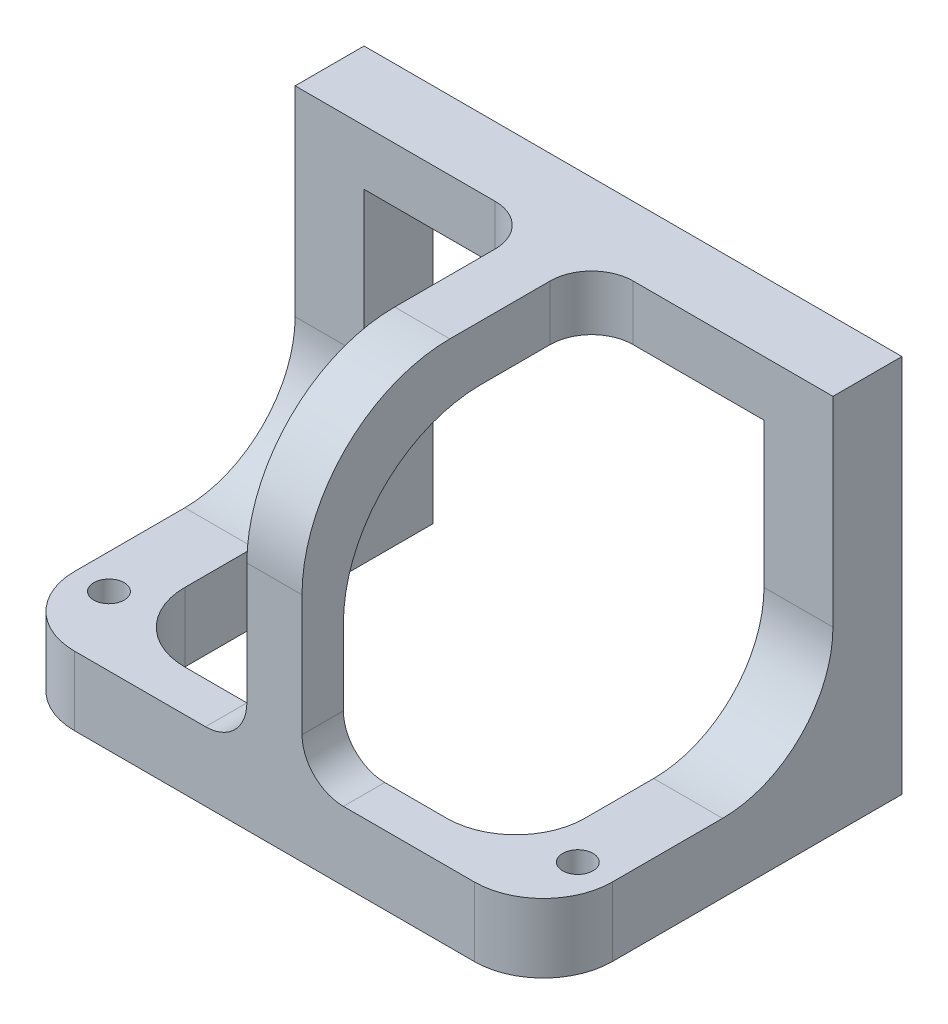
ISO-10303-21;
HEADER;
FILE_DESCRIPTION(('STEP AP214'),'2;1');
FILE_NAME('part.step','',(''),(''),'','','');
FILE_SCHEMA(('AUTOMOTIVE_DESIGN { 1 0 10303 214 1 1 1 1 }'));
ENDSEC;
DATA;
#1=APPLICATION_CONTEXT('core data for automotive mechanical design processes');
#2=APPLICATION_PROTOCOL_DEFINITION('international standard','automotive_design',2000,#1);
#3=PRODUCT_CONTEXT('',#1,'mechanical');
#4=PRODUCT('Part','Part','',(#3));
#5=PRODUCT_RELATED_PRODUCT_CATEGORY('part','',(#4));
#6=PRODUCT_DEFINITION_FORMATION('','',#4);
#7=PRODUCT_DEFINITION_CONTEXT('part definition',#1,'design');
#8=PRODUCT_DEFINITION('design','',#6,#7);
#9=PRODUCT_DEFINITION_SHAPE('','',#8);
#10=(LENGTH_UNIT() NAMED_UNIT(*) SI_UNIT(.MILLI.,.METRE.));
#11=(NAMED_UNIT(*) PLANE_ANGLE_UNIT() SI_UNIT($,.RADIAN.));
#12=(NAMED_UNIT(*) SI_UNIT($,.STERADIAN.) SOLID_ANGLE_UNIT());
#13=UNCERTAINTY_MEASURE_WITH_UNIT(LENGTH_MEASURE(1.E-05),#10,'distance_accuracy_value','');
#14=(GEOMETRIC_REPRESENTATION_CONTEXT(3) GLOBAL_UNCERTAINTY_ASSIGNED_CONTEXT((#13)) GLOBAL_UNIT_ASSIGNED_CONTEXT((#10,
#11,#12)) REPRESENTATION_CONTEXT('',''));
#15=CARTESIAN_POINT('',(0.,0.,0.));
#16=DIRECTION('',(0.,0.,1.));
#17=DIRECTION('',(1.,0.,0.));
#18=AXIS2_PLACEMENT_3D('',#15,#16,#17);
#19=CARTESIAN_POINT('',(0.,0.,5.));
#20=DIRECTION('',(0.,0.,1.));
#21=DIRECTION('',(1.,0.,0.));
#22=AXIS2_PLACEMENT_3D('',#19,#20,#21);
#23=PLANE('',#22);
#24=DIRECTION('',(1.,0.,0.));
#25=VECTOR('',#24,1.);
#26=CARTESIAN_POINT('',(-14.5,23.5,5.));
#27=LINE('',#26,#25);
#28=CARTESIAN_POINT('',(-14.5,23.5,5.));
#29=VERTEX_POINT('',#28);
#30=CARTESIAN_POINT('',(-5.,23.5,5.));
#31=VERTEX_POINT('',#30);
#32=EDGE_CURVE('E269',#29,#31,#27,.T.);
#33=ORIENTED_EDGE('',*,*,#32,.T.);
#34=DIRECTION('',(0.,1.,0.));
#35=VECTOR('',#34,1.);
#36=CARTESIAN_POINT('',(-5.,0.,5.));
#37=LINE('',#36,#35);
#38=CARTESIAN_POINT('',(-5.,27.5,5.));
#39=VERTEX_POINT('',#38);
#40=EDGE_CURVE('E301',#31,#39,#37,.T.);
#41=ORIENTED_EDGE('',*,*,#40,.T.);
#42=DIRECTION('',(-1.,0.,0.));
#43=VECTOR('',#42,1.);
#44=CARTESIAN_POINT('',(19.5,27.5,5.));
#45=LINE('',#44,#43);
#46=CARTESIAN_POINT('',(-19.5,27.5,5.));
#47=VERTEX_POINT('',#46);
#48=EDGE_CURVE('E286',#39,#47,#45,.T.);
#49=ORIENTED_EDGE('',*,*,#48,.T.);
#50=DIRECTION('',(0.,-1.,0.));
#51=VECTOR('',#50,1.);
#52=CARTESIAN_POINT('',(-19.5,4.,5.));
#53=LINE('',#52,#51);
#54=CARTESIAN_POINT('',(-19.5,13.,5.));
#55=VERTEX_POINT('',#54);
#56=EDGE_CURVE('E285',#47,#55,#53,.T.);
#57=ORIENTED_EDGE('',*,*,#56,.T.);
#58=DIRECTION('',(1.,0.,0.));
#59=VECTOR('',#58,1.);
#60=CARTESIAN_POINT('',(-14.5,13.,5.));
#61=LINE('',#60,#59);
#62=CARTESIAN_POINT('',(-14.5,13.,5.));
#63=VERTEX_POINT('',#62);
#64=EDGE_CURVE('E359',#55,#63,#61,.T.);
#65=ORIENTED_EDGE('',*,*,#64,.T.);
#66=DIRECTION('',(0.,1.,0.));
#67=VECTOR('',#66,1.);
#68=CARTESIAN_POINT('',(-14.5,23.5,5.));
#69=LINE('',#68,#67);
#70=EDGE_CURVE('E382',#63,#29,#69,.T.);
#71=ORIENTED_EDGE('',*,*,#70,.T.);
#72=EDGE_LOOP('',(#33,#41,#49,#57,#65,#71));
#73=FACE_BOUND('',#72,.T.);
#74=ADVANCED_FACE('F34',(#73),#23,.T.);
#75=CARTESIAN_POINT('',(14.5,23.5,5.));
#76=DIRECTION('',(1.,0.,0.));
#77=DIRECTION('',(0.,0.,-1.));
#78=AXIS2_PLACEMENT_3D('',#75,#76,#77);
#79=PLANE('',#78);
#80=DIRECTION('',(0.,0.,-1.));
#81=VECTOR('',#80,1.);
#82=CARTESIAN_POINT('',(14.5,0.,5.));
#83=LINE('',#82,#81);
#84=CARTESIAN_POINT('',(14.5,0.,18.));
#85=VERTEX_POINT('',#84);
#86=CARTESIAN_POINT('',(14.5,0.,0.));
#87=VERTEX_POINT('',#86);
#88=EDGE_CURVE('E278',#85,#87,#83,.T.);
#89=ORIENTED_EDGE('',*,*,#88,.F.);
#90=DIRECTION('',(0.,-1.,0.));
#91=VECTOR('',#90,1.);
#92=CARTESIAN_POINT('',(14.5,5.,18.));
#93=LINE('',#92,#91);
#94=CARTESIAN_POINT('',(14.5,5.,18.));
#95=VERTEX_POINT('',#94);
#96=EDGE_CURVE('E338',#85,#95,#93,.F.);
#97=ORIENTED_EDGE('',*,*,#96,.T.);
#98=DIRECTION('',(0.,0.,-1.));
#99=VECTOR('',#98,1.);
#100=CARTESIAN_POINT('',(14.5,5.,33.0710678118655));
#101=LINE('',#100,#99);
#102=CARTESIAN_POINT('',(14.5,5.,13.));
#103=VERTEX_POINT('',#102);
#104=EDGE_CURVE('E396',#95,#103,#101,.T.);
#105=ORIENTED_EDGE('',*,*,#104,.T.);
#106=CARTESIAN_POINT('',(14.5,13.,13.));
#107=DIRECTION('',(1.,0.,0.));
#108=DIRECTION('',(0.,0.,-1.));
#109=AXIS2_PLACEMENT_3D('',#106,#107,#108);
#110=CIRCLE('',#109,8.);
#111=CARTESIAN_POINT('',(14.5,13.,5.));
#112=VERTEX_POINT('',#111);
#113=EDGE_CURVE('E364',#103,#112,#110,.T.);
#114=ORIENTED_EDGE('',*,*,#113,.T.);
#115=DIRECTION('',(0.,-1.,0.));
#116=VECTOR('',#115,1.);
#117=CARTESIAN_POINT('',(14.5,23.5,5.));
#118=LINE('',#117,#116);
#119=CARTESIAN_POINT('',(14.5,23.5,5.));
#120=VERTEX_POINT('',#119);
#121=EDGE_CURVE('E264',#120,#112,#118,.T.);
#122=ORIENTED_EDGE('',*,*,#121,.F.);
#123=DIRECTION('',(0.,0.,-1.));
#124=VECTOR('',#123,1.);
#125=CARTESIAN_POINT('',(14.5,23.5,5.));
#126=LINE('',#125,#124);
#127=CARTESIAN_POINT('',(14.5,23.5,0.));
#128=VERTEX_POINT('',#127);
#129=EDGE_CURVE('E265',#120,#128,#126,.T.);
#130=ORIENTED_EDGE('',*,*,#129,.T.);
#131=DIRECTION('',(0.,-1.,0.));
#132=VECTOR('',#131,1.);
#133=CARTESIAN_POINT('',(14.5,23.5,0.));
#134=LINE('',#133,#132);
#135=EDGE_CURVE('E440',#128,#87,#134,.T.);
#136=ORIENTED_EDGE('',*,*,#135,.T.);
#137=EDGE_LOOP('',(#89,#97,#105,#114,#122,#130,#136));
#138=FACE_BOUND('',#137,.T.);
#139=ADVANCED_FACE('F559',(#138),#79,.F.);
#140=CARTESIAN_POINT('',(2.,13.5,13.));
#141=DIRECTION('',(1.,0.,0.));
#142=DIRECTION('',(0.,0.,-1.));
#143=AXIS2_PLACEMENT_3D('',#140,#141,#142);
#144=PLANE('',#143);
#145=DIRECTION('',(0.,0.,-1.));
#146=VECTOR('',#145,1.);
#147=CARTESIAN_POINT('',(2.,23.5,5.));
#148=LINE('',#147,#146);
#149=CARTESIAN_POINT('',(2.,23.5,13.));
#150=VERTEX_POINT('',#149);
#151=CARTESIAN_POINT('',(2.,23.5,8.));
#152=VERTEX_POINT('',#151);
#153=EDGE_CURVE('E415',#150,#152,#148,.T.);
#154=ORIENTED_EDGE('',*,*,#153,.T.);
#155=DIRECTION('',(0.,1.,0.));
#156=VECTOR('',#155,1.);
#157=CARTESIAN_POINT('',(2.,27.5,8.));
#158=LINE('',#157,#156);
#159=CARTESIAN_POINT('',(2.,27.5,8.));
#160=VERTEX_POINT('',#159);
#161=EDGE_CURVE('E495',#152,#160,#158,.T.);
#162=ORIENTED_EDGE('',*,*,#161,.T.);
#163=DIRECTION('',(0.,0.,1.));
#164=VECTOR('',#163,1.);
#165=CARTESIAN_POINT('',(2.,27.5,5.));
#166=LINE('',#165,#164);
#167=CARTESIAN_POINT('',(2.,27.5,15.283882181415));
#168=VERTEX_POINT('',#167);
#169=EDGE_CURVE('E408',#160,#168,#166,.T.);
#170=ORIENTED_EDGE('',*,*,#169,.T.);
#171=CARTESIAN_POINT('',(2.,16.783882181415,15.283882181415));
#172=DIRECTION('',(1.,0.,0.));
#173=DIRECTION('',(0.,0.,-1.));
#174=AXIS2_PLACEMENT_3D('',#171,#172,#173);
#175=CIRCLE('',#174,10.716117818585);
#176=CARTESIAN_POINT('',(2.,16.783882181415,26.));
#177=VERTEX_POINT('',#176);
#178=EDGE_CURVE('E405',#168,#177,#175,.T.);
#179=ORIENTED_EDGE('',*,*,#178,.T.);
#180=DIRECTION('',(0.,-1.,0.));
#181=VECTOR('',#180,1.);
#182=CARTESIAN_POINT('',(2.,0.,26.));
#183=LINE('',#182,#181);
#184=CARTESIAN_POINT('',(2.,8.,26.));
#185=VERTEX_POINT('',#184);
#186=EDGE_CURVE('E407',#177,#185,#183,.T.);
#187=ORIENTED_EDGE('',*,*,#186,.T.);
#188=DIRECTION('',(0.,0.,1.));
#189=VECTOR('',#188,1.);
#190=CARTESIAN_POINT('',(2.,8.,13.));
#191=LINE('',#190,#189);
#192=CARTESIAN_POINT('',(2.,8.,23.));
#193=VERTEX_POINT('',#192);
#194=EDGE_CURVE('E511',#185,#193,#191,.F.);
#195=ORIENTED_EDGE('',*,*,#194,.T.);
#196=DIRECTION('',(0.,1.,0.));
#197=VECTOR('',#196,1.);
#198=CARTESIAN_POINT('',(2.,13.5,23.));
#199=LINE('',#198,#197);
#200=CARTESIAN_POINT('',(2.,13.5,23.));
#201=VERTEX_POINT('',#200);
#202=EDGE_CURVE('E411',#193,#201,#199,.T.);
#203=ORIENTED_EDGE('',*,*,#202,.T.);
#204=CARTESIAN_POINT('',(2.,13.5,13.));
#205=DIRECTION('',(-1.,0.,0.));
#206=DIRECTION('',(0.,0.,-1.));
#207=AXIS2_PLACEMENT_3D('',#204,#205,#206);
#208=CIRCLE('',#207,10.);
#209=EDGE_CURVE('E413',#201,#150,#208,.T.);
#210=ORIENTED_EDGE('',*,*,#209,.T.);
#211=EDGE_LOOP('',(#154,#162,#170,#179,#187,#195,#203,#210));
#212=FACE_BOUND('',#211,.T.);
#213=ADVANCED_FACE('F541',(#212),#144,.T.);
#214=CARTESIAN_POINT('',(19.5,27.5,5.));
#215=VERTEX_POINT('',#214);
#216=CARTESIAN_POINT('',(5.,27.5,5.));
#217=VERTEX_POINT('',#216);
#218=EDGE_CURVE('E281',#215,#217,#45,.T.);
#219=ORIENTED_EDGE('',*,*,#218,.T.);
#220=DIRECTION('',(0.,1.,0.));
#221=VECTOR('',#220,1.);
#222=CARTESIAN_POINT('',(5.,23.5,5.));
#223=LINE('',#222,#221);
#224=CARTESIAN_POINT('',(5.,23.5,5.));
#225=VERTEX_POINT('',#224);
#226=EDGE_CURVE('E492',#217,#225,#223,.F.);
#227=ORIENTED_EDGE('',*,*,#226,.T.);
#228=EDGE_CURVE('E543',#225,#120,#27,.T.);
#229=ORIENTED_EDGE('',*,*,#228,.T.);
#230=ORIENTED_EDGE('',*,*,#121,.T.);
#231=DIRECTION('',(-1.,0.,0.));
#232=VECTOR('',#231,1.);
#233=CARTESIAN_POINT('',(0.,13.,5.));
#234=LINE('',#233,#232);
#235=CARTESIAN_POINT('',(19.5,13.,5.));
#236=VERTEX_POINT('',#235);
#237=EDGE_CURVE('E357',#112,#236,#234,.F.);
#238=ORIENTED_EDGE('',*,*,#237,.T.);
#239=DIRECTION('',(0.,1.,0.));
#240=VECTOR('',#239,1.);
#241=CARTESIAN_POINT('',(19.5,4.,5.));
#242=LINE('',#241,#240);
#243=EDGE_CURVE('E292',#236,#215,#242,.T.);
#244=ORIENTED_EDGE('',*,*,#243,.T.);
#245=EDGE_LOOP('',(#219,#227,#229,#230,#238,#244));
#246=FACE_BOUND('',#245,.T.);
#247=ADVANCED_FACE('F447',(#246),#23,.T.);
#248=CARTESIAN_POINT('',(19.5,4.,5.));
#249=DIRECTION('',(-1.,0.,0.));
#250=DIRECTION('',(0.,0.,1.));
#251=AXIS2_PLACEMENT_3D('',#248,#249,#250);
#252=PLANE('',#251);
#253=DIRECTION('',(0.,0.,-1.));
#254=VECTOR('',#253,1.);
#255=CARTESIAN_POINT('',(19.5,5.,33.0710678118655));
#256=LINE('',#255,#254);
#257=CARTESIAN_POINT('',(19.5,5.,21.));
#258=VERTEX_POINT('',#257);
#259=CARTESIAN_POINT('',(19.5,5.,13.));
#260=VERTEX_POINT('',#259);
#261=EDGE_CURVE('E399',#258,#260,#256,.T.);
#262=ORIENTED_EDGE('',*,*,#261,.F.);
#263=DIRECTION('',(0.,-1.,0.));
#264=VECTOR('',#263,1.);
#265=CARTESIAN_POINT('',(19.5,4.,21.));
#266=LINE('',#265,#264);
#267=CARTESIAN_POINT('',(19.5,0.,21.));
#268=VERTEX_POINT('',#267);
#269=EDGE_CURVE('E340',#258,#268,#266,.T.);
#270=ORIENTED_EDGE('',*,*,#269,.T.);
#271=DIRECTION('',(0.,0.,-1.));
#272=VECTOR('',#271,1.);
#273=CARTESIAN_POINT('',(19.5,0.,33.0710678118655));
#274=LINE('',#273,#272);
#275=CARTESIAN_POINT('',(19.5,0.,0.));
#276=VERTEX_POINT('',#275);
#277=EDGE_CURVE('E402',#268,#276,#274,.T.);
#278=ORIENTED_EDGE('',*,*,#277,.T.);
#279=DIRECTION('',(0.,1.,0.));
#280=VECTOR('',#279,1.);
#281=CARTESIAN_POINT('',(19.5,4.,0.));
#282=LINE('',#281,#280);
#283=CARTESIAN_POINT('',(19.5,27.5,0.));
#284=VERTEX_POINT('',#283);
#285=EDGE_CURVE('E454',#276,#284,#282,.T.);
#286=ORIENTED_EDGE('',*,*,#285,.T.);
#287=DIRECTION('',(0.,0.,-1.));
#288=VECTOR('',#287,1.);
#289=CARTESIAN_POINT('',(19.5,27.5,5.));
#290=LINE('',#289,#288);
#291=EDGE_CURVE('E275',#215,#284,#290,.T.);
#292=ORIENTED_EDGE('',*,*,#291,.F.);
#293=ORIENTED_EDGE('',*,*,#243,.F.);
#294=CARTESIAN_POINT('',(19.5,13.,13.));
#295=DIRECTION('',(-1.,0.,0.));
#296=DIRECTION('',(0.,0.,1.));
#297=AXIS2_PLACEMENT_3D('',#294,#295,#296);
#298=CIRCLE('',#297,8.);
#299=EDGE_CURVE('E366',#236,#260,#298,.T.);
#300=ORIENTED_EDGE('',*,*,#299,.T.);
#301=EDGE_LOOP('',(#262,#270,#278,#286,#292,#293,#300));
#302=FACE_BOUND('',#301,.T.);
#303=ADVANCED_FACE('F453',(#302),#252,.F.);
#304=CARTESIAN_POINT('',(19.5,27.5,5.));
#305=DIRECTION('',(0.,-1.,0.));
#306=DIRECTION('',(0.,0.,-1.));
#307=AXIS2_PLACEMENT_3D('',#304,#305,#306);
#308=PLANE('',#307);
#309=DIRECTION('',(-1.,0.,0.));
#310=VECTOR('',#309,1.);
#311=CARTESIAN_POINT('',(19.5,27.5,0.));
#312=LINE('',#311,#310);
#313=CARTESIAN_POINT('',(-19.5,27.5,0.));
#314=VERTEX_POINT('',#313);
#315=EDGE_CURVE('E252',#284,#314,#312,.T.);
#316=ORIENTED_EDGE('',*,*,#315,.T.);
#317=DIRECTION('',(0.,0.,-1.));
#318=VECTOR('',#317,1.);
#319=CARTESIAN_POINT('',(-19.5,27.5,5.));
#320=LINE('',#319,#318);
#321=EDGE_CURVE('E249',#47,#314,#320,.T.);
#322=ORIENTED_EDGE('',*,*,#321,.F.);
#323=ORIENTED_EDGE('',*,*,#48,.F.);
#324=CARTESIAN_POINT('',(-5.,27.5,8.));
#325=DIRECTION('',(0.,-1.,0.));
#326=DIRECTION('',(0.,0.,-1.));
#327=AXIS2_PLACEMENT_3D('',#324,#325,#326);
#328=CIRCLE('',#327,3.);
#329=CARTESIAN_POINT('',(-2.,27.5,8.));
#330=VERTEX_POINT('',#329);
#331=EDGE_CURVE('E468',#39,#330,#328,.T.);
#332=ORIENTED_EDGE('',*,*,#331,.T.);
#333=DIRECTION('',(0.,0.,1.));
#334=VECTOR('',#333,1.);
#335=CARTESIAN_POINT('',(-2.,27.5,5.));
#336=LINE('',#335,#334);
#337=CARTESIAN_POINT('',(-2.,27.5,15.283882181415));
#338=VERTEX_POINT('',#337);
#339=EDGE_CURVE('E305',#330,#338,#336,.T.);
#340=ORIENTED_EDGE('',*,*,#339,.T.);
#341=DIRECTION('',(-1.,0.,0.));
#342=VECTOR('',#341,1.);
#343=CARTESIAN_POINT('',(2.,27.5,15.283882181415));
#344=LINE('',#343,#342);
#345=EDGE_CURVE('E438',#168,#338,#344,.T.);
#346=ORIENTED_EDGE('',*,*,#345,.F.);
#347=ORIENTED_EDGE('',*,*,#169,.F.);
#348=CARTESIAN_POINT('',(5.,27.5,8.));
#349=DIRECTION('',(0.,-1.,0.));
#350=DIRECTION('',(0.,0.,-1.));
#351=AXIS2_PLACEMENT_3D('',#348,#349,#350);
#352=CIRCLE('',#351,3.);
#353=EDGE_CURVE('E458',#160,#217,#352,.T.);
#354=ORIENTED_EDGE('',*,*,#353,.T.);
#355=ORIENTED_EDGE('',*,*,#218,.F.);
#356=ORIENTED_EDGE('',*,*,#291,.T.);
#357=EDGE_LOOP('',(#316,#322,#323,#332,#340,#346,#347,#354,#355,#356));
#358=FACE_BOUND('',#357,.T.);
#359=ADVANCED_FACE('F456',(#358),#308,.F.);
#360=CARTESIAN_POINT('',(-19.5,4.,5.));
#361=DIRECTION('',(1.,0.,0.));
#362=DIRECTION('',(0.,0.,-1.));
#363=AXIS2_PLACEMENT_3D('',#360,#361,#362);
#364=PLANE('',#363);
#365=DIRECTION('',(0.,0.,-1.));
#366=VECTOR('',#365,1.);
#367=CARTESIAN_POINT('',(-19.5,0.,33.0710678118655));
#368=LINE('',#367,#366);
#369=CARTESIAN_POINT('',(-19.5,0.,21.));
#370=VERTEX_POINT('',#369);
#371=CARTESIAN_POINT('',(-19.5,0.,0.));
#372=VERTEX_POINT('',#371);
#373=EDGE_CURVE('E229',#370,#372,#368,.T.);
#374=ORIENTED_EDGE('',*,*,#373,.F.);
#375=DIRECTION('',(0.,-1.,0.));
#376=VECTOR('',#375,1.);
#377=CARTESIAN_POINT('',(-19.5,4.,21.));
#378=LINE('',#377,#376);
#379=CARTESIAN_POINT('',(-19.5,5.,21.));
#380=VERTEX_POINT('',#379);
#381=EDGE_CURVE('E333',#370,#380,#378,.F.);
#382=ORIENTED_EDGE('',*,*,#381,.T.);
#383=DIRECTION('',(0.,0.,-1.));
#384=VECTOR('',#383,1.);
#385=CARTESIAN_POINT('',(-19.5,5.,33.0710678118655));
#386=LINE('',#385,#384);
#387=CARTESIAN_POINT('',(-19.5,5.,13.));
#388=VERTEX_POINT('',#387);
#389=EDGE_CURVE('E240',#380,#388,#386,.T.);
#390=ORIENTED_EDGE('',*,*,#389,.T.);
#391=CARTESIAN_POINT('',(-19.5,13.,13.));
#392=DIRECTION('',(1.,0.,0.));
#393=DIRECTION('',(0.,0.,-1.));
#394=AXIS2_PLACEMENT_3D('',#391,#392,#393);
#395=CIRCLE('',#394,8.);
#396=EDGE_CURVE('E299',#388,#55,#395,.T.);
#397=ORIENTED_EDGE('',*,*,#396,.T.);
#398=ORIENTED_EDGE('',*,*,#56,.F.);
#399=ORIENTED_EDGE('',*,*,#321,.T.);
#400=DIRECTION('',(0.,-1.,0.));
#401=VECTOR('',#400,1.);
#402=CARTESIAN_POINT('',(-19.5,4.,0.));
#403=LINE('',#402,#401);
#404=EDGE_CURVE('E245',#314,#372,#403,.T.);
#405=ORIENTED_EDGE('',*,*,#404,.T.);
#406=EDGE_LOOP('',(#374,#382,#390,#397,#398,#399,#405));
#407=FACE_BOUND('',#406,.T.);
#408=ADVANCED_FACE('F246',(#407),#364,.F.);
#409=CARTESIAN_POINT('',(-14.5,0.,5.));
#410=DIRECTION('',(0.,1.,0.));
#411=DIRECTION('',(-1.,0.,0.));
#412=AXIS2_PLACEMENT_3D('',#409,#410,#411);
#413=PLANE('',#412);
#414=CARTESIAN_POINT('',(-17.,0.,21.));
#415=DIRECTION('',(0.,1.,0.));
#416=DIRECTION('',(0.,0.,1.));
#417=AXIS2_PLACEMENT_3D('',#414,#415,#416);
#418=CIRCLE('',#417,1.1);
#419=CARTESIAN_POINT('',(-17.,0.,22.1));
#420=VERTEX_POINT('',#419);
#421=EDGE_CURVE('E783',#420,#420,#418,.T.);
#422=ORIENTED_EDGE('',*,*,#421,.T.);
#423=EDGE_LOOP('',(#422));
#424=FACE_BOUND('',#423,.T.);
#425=CARTESIAN_POINT('',(17.,0.,21.));
#426=DIRECTION('',(0.,1.,0.));
#427=DIRECTION('',(0.,0.,-1.));
#428=AXIS2_PLACEMENT_3D('',#425,#426,#427);
#429=CIRCLE('',#428,1.1);
#430=CARTESIAN_POINT('',(17.,0.,19.9));
#431=VERTEX_POINT('',#430);
#432=EDGE_CURVE('E791',#431,#431,#429,.T.);
#433=ORIENTED_EDGE('',*,*,#432,.T.);
#434=EDGE_LOOP('',(#433));
#435=FACE_BOUND('',#434,.T.);
#436=CARTESIAN_POINT('',(17.,0.,2.5));
#437=DIRECTION('',(0.,1.,0.));
#438=DIRECTION('',(0.,0.,-1.));
#439=AXIS2_PLACEMENT_3D('',#436,#437,#438);
#440=CIRCLE('',#439,1.);
#441=CARTESIAN_POINT('',(17.,0.,1.5));
#442=VERTEX_POINT('',#441);
#443=EDGE_CURVE('E794',#442,#442,#440,.T.);
#444=ORIENTED_EDGE('',*,*,#443,.T.);
#445=EDGE_LOOP('',(#444));
#446=FACE_BOUND('',#445,.T.);
#447=CARTESIAN_POINT('',(-17.,0.,2.5));
#448=DIRECTION('',(0.,1.,0.));
#449=DIRECTION('',(0.,0.,1.));
#450=AXIS2_PLACEMENT_3D('',#447,#448,#449);
#451=CIRCLE('',#450,1.);
#452=CARTESIAN_POINT('',(-17.,0.,3.5));
#453=VERTEX_POINT('',#452);
#454=EDGE_CURVE('E776',#453,#453,#451,.T.);
#455=ORIENTED_EDGE('',*,*,#454,.T.);
#456=EDGE_LOOP('',(#455));
#457=FACE_BOUND('',#456,.T.);
#458=DIRECTION('',(-1.,0.,0.));
#459=VECTOR('',#458,1.);
#460=CARTESIAN_POINT('',(2.,0.,26.));
#461=LINE('',#460,#459);
#462=CARTESIAN_POINT('',(14.5,0.,26.));
#463=VERTEX_POINT('',#462);
#464=CARTESIAN_POINT('',(-14.5,0.,26.));
#465=VERTEX_POINT('',#464);
#466=EDGE_CURVE('E433',#463,#465,#461,.T.);
#467=ORIENTED_EDGE('',*,*,#466,.T.);
#468=CARTESIAN_POINT('',(-14.5,0.,21.));
#469=DIRECTION('',(0.,1.,0.));
#470=DIRECTION('',(-1.,0.,0.));
#471=AXIS2_PLACEMENT_3D('',#468,#469,#470);
#472=CIRCLE('',#471,5.);
#473=EDGE_CURVE('E237',#465,#370,#472,.F.);
#474=ORIENTED_EDGE('',*,*,#473,.T.);
#475=ORIENTED_EDGE('',*,*,#373,.T.);
#476=DIRECTION('',(1.,0.,0.));
#477=VECTOR('',#476,1.);
#478=CARTESIAN_POINT('',(-14.5,0.,0.));
#479=LINE('',#478,#477);
#480=CARTESIAN_POINT('',(-14.5,0.,0.));
#481=VERTEX_POINT('',#480);
#482=EDGE_CURVE('E235',#372,#481,#479,.T.);
#483=ORIENTED_EDGE('',*,*,#482,.T.);
#484=DIRECTION('',(0.,0.,-1.));
#485=VECTOR('',#484,1.);
#486=CARTESIAN_POINT('',(-14.5,0.,5.));
#487=LINE('',#486,#485);
#488=CARTESIAN_POINT('',(-14.5,0.,18.));
#489=VERTEX_POINT('',#488);
#490=EDGE_CURVE('E272',#489,#481,#487,.T.);
#491=ORIENTED_EDGE('',*,*,#490,.F.);
#492=CARTESIAN_POINT('',(-9.5,0.,18.));
#493=DIRECTION('',(0.,1.,0.));
#494=DIRECTION('',(-1.,0.,0.));
#495=AXIS2_PLACEMENT_3D('',#492,#493,#494);
#496=CIRCLE('',#495,5.);
#497=CARTESIAN_POINT('',(-9.5,0.,23.));
#498=VERTEX_POINT('',#497);
#499=EDGE_CURVE('E345',#489,#498,#496,.T.);
#500=ORIENTED_EDGE('',*,*,#499,.T.);
#501=DIRECTION('',(-1.,0.,0.));
#502=VECTOR('',#501,1.);
#503=CARTESIAN_POINT('',(2.,0.,23.));
#504=LINE('',#503,#502);
#505=CARTESIAN_POINT('',(9.5,0.,23.));
#506=VERTEX_POINT('',#505);
#507=EDGE_CURVE('E430',#506,#498,#504,.T.);
#508=ORIENTED_EDGE('',*,*,#507,.F.);
#509=CARTESIAN_POINT('',(9.5,0.,18.));
#510=DIRECTION('',(0.,1.,0.));
#511=DIRECTION('',(-1.,0.,0.));
#512=AXIS2_PLACEMENT_3D('',#509,#510,#511);
#513=CIRCLE('',#512,5.);
#514=EDGE_CURVE('E349',#506,#85,#513,.T.);
#515=ORIENTED_EDGE('',*,*,#514,.T.);
#516=ORIENTED_EDGE('',*,*,#88,.T.);
#517=DIRECTION('',(1.,0.,0.));
#518=VECTOR('',#517,1.);
#519=CARTESIAN_POINT('',(14.5,0.,0.));
#520=LINE('',#519,#518);
#521=EDGE_CURVE('E549',#87,#276,#520,.T.);
#522=ORIENTED_EDGE('',*,*,#521,.T.);
#523=ORIENTED_EDGE('',*,*,#277,.F.);
#524=CARTESIAN_POINT('',(14.5,0.,21.));
#525=DIRECTION('',(0.,1.,0.));
#526=DIRECTION('',(-1.,0.,0.));
#527=AXIS2_PLACEMENT_3D('',#524,#525,#526);
#528=CIRCLE('',#527,5.);
#529=EDGE_CURVE('E330',#268,#463,#528,.F.);
#530=ORIENTED_EDGE('',*,*,#529,.T.);
#531=EDGE_LOOP('',(#467,#474,#475,#483,#491,#500,#508,#515,#516,#522,#523,#530));
#532=FACE_BOUND('',#531,.T.);
#533=ADVANCED_FACE('F232',(#424,#435,#446,#457,#532),#413,.F.);
#534=CARTESIAN_POINT('',(-14.5,23.5,5.));
#535=DIRECTION('',(-1.,0.,0.));
#536=DIRECTION('',(0.,0.,1.));
#537=AXIS2_PLACEMENT_3D('',#534,#535,#536);
#538=PLANE('',#537);
#539=DIRECTION('',(0.,0.,-1.));
#540=VECTOR('',#539,1.);
#541=CARTESIAN_POINT('',(-14.5,5.,33.0710678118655));
#542=LINE('',#541,#540);
#543=CARTESIAN_POINT('',(-14.5,5.,18.));
#544=VERTEX_POINT('',#543);
#545=CARTESIAN_POINT('',(-14.5,5.,13.));
#546=VERTEX_POINT('',#545);
#547=EDGE_CURVE('E386',#544,#546,#542,.T.);
#548=ORIENTED_EDGE('',*,*,#547,.F.);
#549=DIRECTION('',(0.,-1.,0.));
#550=VECTOR('',#549,1.);
#551=CARTESIAN_POINT('',(-14.5,0.,18.));
#552=LINE('',#551,#550);
#553=EDGE_CURVE('E280',#544,#489,#552,.T.);
#554=ORIENTED_EDGE('',*,*,#553,.T.);
#555=ORIENTED_EDGE('',*,*,#490,.T.);
#556=DIRECTION('',(0.,1.,0.));
#557=VECTOR('',#556,1.);
#558=CARTESIAN_POINT('',(-14.5,23.5,0.));
#559=LINE('',#558,#557);
#560=CARTESIAN_POINT('',(-14.5,23.5,0.));
#561=VERTEX_POINT('',#560);
#562=EDGE_CURVE('E257',#481,#561,#559,.T.);
#563=ORIENTED_EDGE('',*,*,#562,.T.);
#564=DIRECTION('',(0.,0.,-1.));
#565=VECTOR('',#564,1.);
#566=CARTESIAN_POINT('',(-14.5,23.5,5.));
#567=LINE('',#566,#565);
#568=EDGE_CURVE('E268',#29,#561,#567,.T.);
#569=ORIENTED_EDGE('',*,*,#568,.F.);
#570=ORIENTED_EDGE('',*,*,#70,.F.);
#571=CARTESIAN_POINT('',(-14.5,13.,13.));
#572=DIRECTION('',(-1.,0.,0.));
#573=DIRECTION('',(0.,0.,1.));
#574=AXIS2_PLACEMENT_3D('',#571,#572,#573);
#575=CIRCLE('',#574,8.);
#576=EDGE_CURVE('E367',#63,#546,#575,.T.);
#577=ORIENTED_EDGE('',*,*,#576,.T.);
#578=EDGE_LOOP('',(#548,#554,#555,#563,#569,#570,#577));
#579=FACE_BOUND('',#578,.T.);
#580=ADVANCED_FACE('F565',(#579),#538,.F.);
#581=CARTESIAN_POINT('',(-14.5,23.5,5.));
#582=DIRECTION('',(0.,1.,0.));
#583=DIRECTION('',(0.,0.,1.));
#584=AXIS2_PLACEMENT_3D('',#581,#582,#583);
#585=PLANE('',#584);
#586=DIRECTION('',(1.,0.,0.));
#587=VECTOR('',#586,1.);
#588=CARTESIAN_POINT('',(-14.5,23.5,0.));
#589=LINE('',#588,#587);
#590=EDGE_CURVE('E259',#561,#128,#589,.T.);
#591=ORIENTED_EDGE('',*,*,#590,.T.);
#592=ORIENTED_EDGE('',*,*,#129,.F.);
#593=ORIENTED_EDGE('',*,*,#228,.F.);
#594=CARTESIAN_POINT('',(5.,23.5,8.));
#595=DIRECTION('',(0.,1.,0.));
#596=DIRECTION('',(0.,0.,1.));
#597=AXIS2_PLACEMENT_3D('',#594,#595,#596);
#598=CIRCLE('',#597,3.);
#599=EDGE_CURVE('E463',#225,#152,#598,.T.);
#600=ORIENTED_EDGE('',*,*,#599,.T.);
#601=ORIENTED_EDGE('',*,*,#153,.F.);
#602=DIRECTION('',(-1.,0.,0.));
#603=VECTOR('',#602,1.);
#604=CARTESIAN_POINT('',(2.,23.5,13.));
#605=LINE('',#604,#603);
#606=CARTESIAN_POINT('',(-2.,23.5,13.));
#607=VERTEX_POINT('',#606);
#608=EDGE_CURVE('E424',#150,#607,#605,.T.);
#609=ORIENTED_EDGE('',*,*,#608,.T.);
#610=DIRECTION('',(0.,0.,-1.));
#611=VECTOR('',#610,1.);
#612=CARTESIAN_POINT('',(-2.,23.5,5.));
#613=LINE('',#612,#611);
#614=CARTESIAN_POINT('',(-2.,23.5,8.));
#615=VERTEX_POINT('',#614);
#616=EDGE_CURVE('E423',#607,#615,#613,.T.);
#617=ORIENTED_EDGE('',*,*,#616,.T.);
#618=CARTESIAN_POINT('',(-5.,23.5,8.));
#619=DIRECTION('',(0.,1.,0.));
#620=DIRECTION('',(0.,0.,1.));
#621=AXIS2_PLACEMENT_3D('',#618,#619,#620);
#622=CIRCLE('',#621,3.);
#623=EDGE_CURVE('E464',#615,#31,#622,.T.);
#624=ORIENTED_EDGE('',*,*,#623,.T.);
#625=ORIENTED_EDGE('',*,*,#32,.F.);
#626=ORIENTED_EDGE('',*,*,#568,.T.);
#627=EDGE_LOOP('',(#591,#592,#593,#600,#601,#609,#617,#624,#625,#626));
#628=FACE_BOUND('',#627,.T.);
#629=ADVANCED_FACE('F522',(#628),#585,.F.);
#630=CARTESIAN_POINT('',(0.,0.,0.));
#631=DIRECTION('',(0.,0.,1.));
#632=DIRECTION('',(1.,0.,0.));
#633=AXIS2_PLACEMENT_3D('',#630,#631,#632);
#634=PLANE('',#633);
#635=ORIENTED_EDGE('',*,*,#285,.F.);
#636=ORIENTED_EDGE('',*,*,#521,.F.);
#637=ORIENTED_EDGE('',*,*,#135,.F.);
#638=ORIENTED_EDGE('',*,*,#590,.F.);
#639=ORIENTED_EDGE('',*,*,#562,.F.);
#640=ORIENTED_EDGE('',*,*,#482,.F.);
#641=ORIENTED_EDGE('',*,*,#404,.F.);
#642=ORIENTED_EDGE('',*,*,#315,.F.);
#643=EDGE_LOOP('',(#635,#636,#637,#638,#639,#640,#641,#642));
#644=FACE_BOUND('',#643,.T.);
#645=ADVANCED_FACE('F255',(#644),#634,.F.);
#646=CARTESIAN_POINT('',(2.,16.783882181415,15.283882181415));
#647=DIRECTION('',(-1.,0.,0.));
#648=DIRECTION('',(0.,0.,1.));
#649=AXIS2_PLACEMENT_3D('',#646,#647,#648);
#650=CYLINDRICAL_SURFACE('',#649,10.716117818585);
#651=CARTESIAN_POINT('',(-2.,16.783882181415,15.283882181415));
#652=DIRECTION('',(1.,0.,0.));
#653=DIRECTION('',(0.,0.,-1.));
#654=AXIS2_PLACEMENT_3D('',#651,#652,#653);
#655=CIRCLE('',#654,10.716117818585);
#656=CARTESIAN_POINT('',(-2.,16.783882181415,26.));
#657=VERTEX_POINT('',#656);
#658=EDGE_CURVE('E308',#338,#657,#655,.T.);
#659=ORIENTED_EDGE('',*,*,#658,.T.);
#660=DIRECTION('',(-1.,0.,0.));
#661=VECTOR('',#660,1.);
#662=CARTESIAN_POINT('',(2.,16.783882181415,26.));
#663=LINE('',#662,#661);
#664=EDGE_CURVE('E435',#177,#657,#663,.T.);
#665=ORIENTED_EDGE('',*,*,#664,.F.);
#666=ORIENTED_EDGE('',*,*,#178,.F.);
#667=ORIENTED_EDGE('',*,*,#345,.T.);
#668=EDGE_LOOP('',(#659,#665,#666,#667));
#669=FACE_BOUND('',#668,.T.);
#670=ADVANCED_FACE('F539',(#669),#650,.T.);
#671=CARTESIAN_POINT('',(2.,0.,26.));
#672=DIRECTION('',(0.,0.,-1.));
#673=DIRECTION('',(0.,1.,0.));
#674=AXIS2_PLACEMENT_3D('',#671,#672,#673);
#675=PLANE('',#674);
#676=DIRECTION('',(0.,-1.,0.));
#677=VECTOR('',#676,1.);
#678=CARTESIAN_POINT('',(-2.,0.,26.));
#679=LINE('',#678,#677);
#680=CARTESIAN_POINT('',(-2.,8.,26.));
#681=VERTEX_POINT('',#680);
#682=EDGE_CURVE('E417',#657,#681,#679,.T.);
#683=ORIENTED_EDGE('',*,*,#682,.T.);
#684=CARTESIAN_POINT('',(-5.,8.,26.));
#685=DIRECTION('',(0.,0.,-1.));
#686=DIRECTION('',(0.,1.,0.));
#687=AXIS2_PLACEMENT_3D('',#684,#685,#686);
#688=CIRCLE('',#687,3.);
#689=CARTESIAN_POINT('',(-5.,5.,26.));
#690=VERTEX_POINT('',#689);
#691=EDGE_CURVE('E42',#681,#690,#688,.T.);
#692=ORIENTED_EDGE('',*,*,#691,.T.);
#693=DIRECTION('',(-1.,0.,0.));
#694=VECTOR('',#693,1.);
#695=CARTESIAN_POINT('',(-14.5,5.,26.));
#696=LINE('',#695,#694);
#697=CARTESIAN_POINT('',(-14.5,5.,26.));
#698=VERTEX_POINT('',#697);
#699=EDGE_CURVE('E389',#690,#698,#696,.T.);
#700=ORIENTED_EDGE('',*,*,#699,.T.);
#701=DIRECTION('',(0.,-1.,0.));
#702=VECTOR('',#701,1.);
#703=CARTESIAN_POINT('',(-14.5,0.,26.));
#704=LINE('',#703,#702);
#705=EDGE_CURVE('E327',#698,#465,#704,.T.);
#706=ORIENTED_EDGE('',*,*,#705,.T.);
#707=ORIENTED_EDGE('',*,*,#466,.F.);
#708=DIRECTION('',(0.,-1.,0.));
#709=VECTOR('',#708,1.);
#710=CARTESIAN_POINT('',(14.5,0.,26.));
#711=LINE('',#710,#709);
#712=CARTESIAN_POINT('',(14.5,5.,26.));
#713=VERTEX_POINT('',#712);
#714=EDGE_CURVE('E324',#463,#713,#711,.F.);
#715=ORIENTED_EDGE('',*,*,#714,.T.);
#716=DIRECTION('',(1.,0.,0.));
#717=VECTOR('',#716,1.);
#718=CARTESIAN_POINT('',(14.5,5.,26.));
#719=LINE('',#718,#717);
#720=CARTESIAN_POINT('',(5.,5.,26.));
#721=VERTEX_POINT('',#720);
#722=EDGE_CURVE('E309',#721,#713,#719,.T.);
#723=ORIENTED_EDGE('',*,*,#722,.F.);
#724=CARTESIAN_POINT('',(5.,8.,26.));
#725=DIRECTION('',(0.,0.,-1.));
#726=DIRECTION('',(0.,1.,0.));
#727=AXIS2_PLACEMENT_3D('',#724,#725,#726);
#728=CIRCLE('',#727,3.);
#729=EDGE_CURVE('E466',#721,#185,#728,.T.);
#730=ORIENTED_EDGE('',*,*,#729,.T.);
#731=ORIENTED_EDGE('',*,*,#186,.F.);
#732=ORIENTED_EDGE('',*,*,#664,.T.);
#733=EDGE_LOOP('',(#683,#692,#700,#706,#707,#715,#723,#730,#731,#732));
#734=FACE_BOUND('',#733,.T.);
#735=ADVANCED_FACE('F534',(#734),#675,.F.);
#736=CARTESIAN_POINT('',(2.,13.5,23.));
#737=DIRECTION('',(0.,0.,1.));
#738=DIRECTION('',(0.,-1.,0.));
#739=AXIS2_PLACEMENT_3D('',#736,#737,#738);
#740=PLANE('',#739);
#741=ORIENTED_EDGE('',*,*,#507,.T.);
#742=DIRECTION('',(0.,-1.,0.));
#743=VECTOR('',#742,1.);
#744=CARTESIAN_POINT('',(-9.5,5.,23.));
#745=LINE('',#744,#743);
#746=CARTESIAN_POINT('',(-9.5,5.,23.));
#747=VERTEX_POINT('',#746);
#748=EDGE_CURVE('E321',#498,#747,#745,.F.);
#749=ORIENTED_EDGE('',*,*,#748,.T.);
#750=DIRECTION('',(-1.,0.,0.));
#751=VECTOR('',#750,1.);
#752=CARTESIAN_POINT('',(7.8309518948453,5.,23.));
#753=LINE('',#752,#751);
#754=CARTESIAN_POINT('',(-5.,5.,23.));
#755=VERTEX_POINT('',#754);
#756=EDGE_CURVE('E241',#755,#747,#753,.T.);
#757=ORIENTED_EDGE('',*,*,#756,.F.);
#758=CARTESIAN_POINT('',(-5.,8.,23.));
#759=DIRECTION('',(0.,0.,1.));
#760=DIRECTION('',(0.,-1.,0.));
#761=AXIS2_PLACEMENT_3D('',#758,#759,#760);
#762=CIRCLE('',#761,3.);
#763=CARTESIAN_POINT('',(-2.,8.,23.));
#764=VERTEX_POINT('',#763);
#765=EDGE_CURVE('E11',#755,#764,#762,.T.);
#766=ORIENTED_EDGE('',*,*,#765,.T.);
#767=DIRECTION('',(0.,1.,0.));
#768=VECTOR('',#767,1.);
#769=CARTESIAN_POINT('',(-2.,13.5,23.));
#770=LINE('',#769,#768);
#771=CARTESIAN_POINT('',(-2.,13.5,23.));
#772=VERTEX_POINT('',#771);
#773=EDGE_CURVE('E419',#764,#772,#770,.T.);
#774=ORIENTED_EDGE('',*,*,#773,.T.);
#775=DIRECTION('',(-1.,0.,0.));
#776=VECTOR('',#775,1.);
#777=CARTESIAN_POINT('',(2.,13.5,23.));
#778=LINE('',#777,#776);
#779=EDGE_CURVE('E427',#201,#772,#778,.T.);
#780=ORIENTED_EDGE('',*,*,#779,.F.);
#781=ORIENTED_EDGE('',*,*,#202,.F.);
#782=CARTESIAN_POINT('',(5.,8.,23.));
#783=DIRECTION('',(0.,0.,1.));
#784=DIRECTION('',(0.,-1.,0.));
#785=AXIS2_PLACEMENT_3D('',#782,#783,#784);
#786=CIRCLE('',#785,3.);
#787=CARTESIAN_POINT('',(5.,5.,23.));
#788=VERTEX_POINT('',#787);
#789=EDGE_CURVE('E473',#193,#788,#786,.T.);
#790=ORIENTED_EDGE('',*,*,#789,.T.);
#791=DIRECTION('',(1.,0.,0.));
#792=VECTOR('',#791,1.);
#793=CARTESIAN_POINT('',(-3.8309518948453,5.,23.));
#794=LINE('',#793,#792);
#795=CARTESIAN_POINT('',(9.5,5.,23.));
#796=VERTEX_POINT('',#795);
#797=EDGE_CURVE('E391',#788,#796,#794,.T.);
#798=ORIENTED_EDGE('',*,*,#797,.T.);
#799=DIRECTION('',(0.,-1.,0.));
#800=VECTOR('',#799,1.);
#801=CARTESIAN_POINT('',(9.5,0.,23.));
#802=LINE('',#801,#800);
#803=EDGE_CURVE('E318',#796,#506,#802,.T.);
#804=ORIENTED_EDGE('',*,*,#803,.T.);
#805=EDGE_LOOP('',(#741,#749,#757,#766,#774,#780,#781,#790,#798,#804));
#806=FACE_BOUND('',#805,.T.);
#807=ADVANCED_FACE('F478',(#806),#740,.F.);
#808=CARTESIAN_POINT('',(2.,13.5,13.));
#809=DIRECTION('',(-1.,0.,0.));
#810=DIRECTION('',(0.,0.,1.));
#811=AXIS2_PLACEMENT_3D('',#808,#809,#810);
#812=CYLINDRICAL_SURFACE('',#811,10.);
#813=CARTESIAN_POINT('',(-2.,13.5,13.));
#814=DIRECTION('',(-1.,0.,0.));
#815=DIRECTION('',(0.,0.,-1.));
#816=AXIS2_PLACEMENT_3D('',#813,#814,#815);
#817=CIRCLE('',#816,10.);
#818=EDGE_CURVE('E421',#772,#607,#817,.T.);
#819=ORIENTED_EDGE('',*,*,#818,.T.);
#820=ORIENTED_EDGE('',*,*,#608,.F.);
#821=ORIENTED_EDGE('',*,*,#209,.F.);
#822=ORIENTED_EDGE('',*,*,#779,.T.);
#823=EDGE_LOOP('',(#819,#820,#821,#822));
#824=FACE_BOUND('',#823,.T.);
#825=ADVANCED_FACE('F530',(#824),#812,.F.);
#826=CARTESIAN_POINT('',(-2.,13.5,13.));
#827=DIRECTION('',(1.,0.,0.));
#828=DIRECTION('',(0.,0.,-1.));
#829=AXIS2_PLACEMENT_3D('',#826,#827,#828);
#830=PLANE('',#829);
#831=ORIENTED_EDGE('',*,*,#339,.F.);
#832=DIRECTION('',(0.,1.,0.));
#833=VECTOR('',#832,1.);
#834=CARTESIAN_POINT('',(-2.,13.5,8.));
#835=LINE('',#834,#833);
#836=EDGE_CURVE('E506',#330,#615,#835,.F.);
#837=ORIENTED_EDGE('',*,*,#836,.T.);
#838=ORIENTED_EDGE('',*,*,#616,.F.);
#839=ORIENTED_EDGE('',*,*,#818,.F.);
#840=ORIENTED_EDGE('',*,*,#773,.F.);
#841=DIRECTION('',(0.,0.,1.));
#842=VECTOR('',#841,1.);
#843=CARTESIAN_POINT('',(-2.,8.,13.));
#844=LINE('',#843,#842);
#845=EDGE_CURVE('E304',#764,#681,#844,.T.);
#846=ORIENTED_EDGE('',*,*,#845,.T.);
#847=ORIENTED_EDGE('',*,*,#682,.F.);
#848=ORIENTED_EDGE('',*,*,#658,.F.);
#849=EDGE_LOOP('',(#831,#837,#838,#839,#840,#846,#847,#848));
#850=FACE_BOUND('',#849,.T.);
#851=ADVANCED_FACE('F504',(#850),#830,.F.);
#852=CARTESIAN_POINT('',(14.5,5.,33.0710678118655));
#853=DIRECTION('',(0.,-1.,0.));
#854=DIRECTION('',(1.,0.,0.));
#855=AXIS2_PLACEMENT_3D('',#852,#853,#854);
#856=PLANE('',#855);
#857=CARTESIAN_POINT('',(17.,5.,21.));
#858=DIRECTION('',(0.,1.,0.));
#859=DIRECTION('',(0.,0.,-1.));
#860=AXIS2_PLACEMENT_3D('',#857,#858,#859);
#861=CIRCLE('',#860,1.1);
#862=CARTESIAN_POINT('',(17.,5.,19.9));
#863=VERTEX_POINT('',#862);
#864=EDGE_CURVE('E789',#863,#863,#861,.T.);
#865=ORIENTED_EDGE('',*,*,#864,.F.);
#866=EDGE_LOOP('',(#865));
#867=FACE_BOUND('',#866,.T.);
#868=ORIENTED_EDGE('',*,*,#797,.F.);
#869=DIRECTION('',(0.,0.,1.));
#870=VECTOR('',#869,1.);
#871=CARTESIAN_POINT('',(5.,5.,33.0710678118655));
#872=LINE('',#871,#870);
#873=EDGE_CURVE('E486',#788,#721,#872,.T.);
#874=ORIENTED_EDGE('',*,*,#873,.T.);
#875=ORIENTED_EDGE('',*,*,#722,.T.);
#876=CARTESIAN_POINT('',(14.5,5.,21.));
#877=DIRECTION('',(0.,-1.,0.));
#878=DIRECTION('',(1.,0.,0.));
#879=AXIS2_PLACEMENT_3D('',#876,#877,#878);
#880=CIRCLE('',#879,5.);
#881=EDGE_CURVE('E343',#713,#258,#880,.F.);
#882=ORIENTED_EDGE('',*,*,#881,.T.);
#883=ORIENTED_EDGE('',*,*,#261,.T.);
#884=DIRECTION('',(-1.,0.,0.));
#885=VECTOR('',#884,1.);
#886=CARTESIAN_POINT('',(14.5,5.,13.));
#887=LINE('',#886,#885);
#888=EDGE_CURVE('E354',#260,#103,#887,.T.);
#889=ORIENTED_EDGE('',*,*,#888,.T.);
#890=ORIENTED_EDGE('',*,*,#104,.F.);
#891=CARTESIAN_POINT('',(9.5,5.,18.));
#892=DIRECTION('',(0.,-1.,0.));
#893=DIRECTION('',(1.,0.,0.));
#894=AXIS2_PLACEMENT_3D('',#891,#892,#893);
#895=CIRCLE('',#894,5.);
#896=EDGE_CURVE('E351',#95,#796,#895,.T.);
#897=ORIENTED_EDGE('',*,*,#896,.T.);
#898=EDGE_LOOP('',(#868,#874,#875,#882,#883,#889,#890,#897));
#899=FACE_BOUND('',#898,.T.);
#900=ADVANCED_FACE('F485',(#867,#899),#856,.F.);
#901=CARTESIAN_POINT('',(-14.5,5.,33.0710678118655));
#902=DIRECTION('',(0.,1.,0.));
#903=DIRECTION('',(-1.,0.,0.));
#904=AXIS2_PLACEMENT_3D('',#901,#902,#903);
#905=PLANE('',#904);
#906=CARTESIAN_POINT('',(-17.,5.,21.));
#907=DIRECTION('',(0.,1.,0.));
#908=DIRECTION('',(0.,0.,1.));
#909=AXIS2_PLACEMENT_3D('',#906,#907,#908);
#910=CIRCLE('',#909,1.1);
#911=CARTESIAN_POINT('',(-17.,5.,22.1));
#912=VERTEX_POINT('',#911);
#913=EDGE_CURVE('E779',#912,#912,#910,.T.);
#914=ORIENTED_EDGE('',*,*,#913,.F.);
#915=EDGE_LOOP('',(#914));
#916=FACE_BOUND('',#915,.T.);
#917=ORIENTED_EDGE('',*,*,#699,.F.);
#918=DIRECTION('',(0.,0.,1.));
#919=VECTOR('',#918,1.);
#920=CARTESIAN_POINT('',(-5.,5.,33.0710678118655));
#921=LINE('',#920,#919);
#922=EDGE_CURVE('E49',#690,#755,#921,.F.);
#923=ORIENTED_EDGE('',*,*,#922,.T.);
#924=ORIENTED_EDGE('',*,*,#756,.T.);
#925=CARTESIAN_POINT('',(-9.5,5.,18.));
#926=DIRECTION('',(0.,1.,0.));
#927=DIRECTION('',(-1.,0.,0.));
#928=AXIS2_PLACEMENT_3D('',#925,#926,#927);
#929=CIRCLE('',#928,5.);
#930=EDGE_CURVE('E347',#747,#544,#929,.F.);
#931=ORIENTED_EDGE('',*,*,#930,.T.);
#932=ORIENTED_EDGE('',*,*,#547,.T.);
#933=DIRECTION('',(1.,0.,0.));
#934=VECTOR('',#933,1.);
#935=CARTESIAN_POINT('',(-19.5,5.,13.));
#936=LINE('',#935,#934);
#937=EDGE_CURVE('E362',#546,#388,#936,.F.);
#938=ORIENTED_EDGE('',*,*,#937,.T.);
#939=ORIENTED_EDGE('',*,*,#389,.F.);
#940=CARTESIAN_POINT('',(-14.5,5.,21.));
#941=DIRECTION('',(0.,1.,0.));
#942=DIRECTION('',(-1.,0.,0.));
#943=AXIS2_PLACEMENT_3D('',#940,#941,#942);
#944=CIRCLE('',#943,5.);
#945=EDGE_CURVE('E335',#380,#698,#944,.T.);
#946=ORIENTED_EDGE('',*,*,#945,.T.);
#947=EDGE_LOOP('',(#917,#923,#924,#931,#932,#938,#939,#946));
#948=FACE_BOUND('',#947,.T.);
#949=ADVANCED_FACE('F384',(#916,#948),#905,.T.);
#950=CARTESIAN_POINT('',(-17.,0.,2.5));
#951=DIRECTION('',(0.,1.,0.));
#952=DIRECTION('',(0.,0.,1.));
#953=AXIS2_PLACEMENT_3D('',#950,#951,#952);
#954=CYLINDRICAL_SURFACE('',#953,1.);
#955=ORIENTED_EDGE('',*,*,#454,.F.);
#956=EDGE_LOOP('',(#955));
#957=FACE_BOUND('',#956,.T.);
#958=CARTESIAN_POINT('',(-17.,11.,2.5));
#959=DIRECTION('',(0.,-1.,0.));
#960=DIRECTION('',(0.,0.,-1.));
#961=AXIS2_PLACEMENT_3D('',#958,#959,#960);
#962=CIRCLE('',#961,1.);
#963=CARTESIAN_POINT('',(-17.,11.,1.5));
#964=VERTEX_POINT('',#963);
#965=EDGE_CURVE('E778',#964,#964,#962,.T.);
#966=ORIENTED_EDGE('',*,*,#965,.F.);
#967=EDGE_LOOP('',(#966));
#968=FACE_BOUND('',#967,.T.);
#969=ADVANCED_FACE('F700',(#957,#968),#954,.F.);
#970=CARTESIAN_POINT('',(17.,0.,2.5));
#971=DIRECTION('',(0.,1.,0.));
#972=DIRECTION('',(0.,0.,1.));
#973=AXIS2_PLACEMENT_3D('',#970,#971,#972);
#974=CYLINDRICAL_SURFACE('',#973,1.);
#975=ORIENTED_EDGE('',*,*,#443,.F.);
#976=EDGE_LOOP('',(#975));
#977=FACE_BOUND('',#976,.T.);
#978=CARTESIAN_POINT('',(17.,11.,2.5));
#979=DIRECTION('',(0.,-1.,0.));
#980=DIRECTION('',(0.,0.,-1.));
#981=AXIS2_PLACEMENT_3D('',#978,#979,#980);
#982=CIRCLE('',#981,1.);
#983=CARTESIAN_POINT('',(17.,11.,1.5));
#984=VERTEX_POINT('',#983);
#985=EDGE_CURVE('E780',#984,#984,#982,.T.);
#986=ORIENTED_EDGE('',*,*,#985,.F.);
#987=EDGE_LOOP('',(#986));
#988=FACE_BOUND('',#987,.T.);
#989=ADVANCED_FACE('F765',(#977,#988),#974,.F.);
#990=CARTESIAN_POINT('',(17.,0.,21.));
#991=DIRECTION('',(0.,1.,0.));
#992=DIRECTION('',(0.,0.,1.));
#993=AXIS2_PLACEMENT_3D('',#990,#991,#992);
#994=CYLINDRICAL_SURFACE('',#993,1.1);
#995=ORIENTED_EDGE('',*,*,#432,.F.);
#996=EDGE_LOOP('',(#995));
#997=FACE_BOUND('',#996,.T.);
#998=ORIENTED_EDGE('',*,*,#864,.T.);
#999=EDGE_LOOP('',(#998));
#1000=FACE_BOUND('',#999,.T.);
#1001=ADVANCED_FACE('F761',(#997,#1000),#994,.F.);
#1002=CARTESIAN_POINT('',(-17.,0.,21.));
#1003=DIRECTION('',(0.,1.,0.));
#1004=DIRECTION('',(0.,0.,1.));
#1005=AXIS2_PLACEMENT_3D('',#1002,#1003,#1004);
#1006=CYLINDRICAL_SURFACE('',#1005,1.1);
#1007=ORIENTED_EDGE('',*,*,#421,.F.);
#1008=EDGE_LOOP('',(#1007));
#1009=FACE_BOUND('',#1008,.T.);
#1010=ORIENTED_EDGE('',*,*,#913,.T.);
#1011=EDGE_LOOP('',(#1010));
#1012=FACE_BOUND('',#1011,.T.);
#1013=ADVANCED_FACE('F588',(#1009,#1012),#1006,.F.);
#1014=CARTESIAN_POINT('',(-9.5,23.5,18.));
#1015=DIRECTION('',(0.,1.,0.));
#1016=DIRECTION('',(0.,0.,1.));
#1017=AXIS2_PLACEMENT_3D('',#1014,#1015,#1016);
#1018=CYLINDRICAL_SURFACE('',#1017,5.);
#1019=ORIENTED_EDGE('',*,*,#930,.F.);
#1020=ORIENTED_EDGE('',*,*,#748,.F.);
#1021=ORIENTED_EDGE('',*,*,#499,.F.);
#1022=ORIENTED_EDGE('',*,*,#553,.F.);
#1023=EDGE_LOOP('',(#1019,#1020,#1021,#1022));
#1024=FACE_BOUND('',#1023,.T.);
#1025=ADVANCED_FACE('F564',(#1024),#1018,.F.);
#1026=CARTESIAN_POINT('',(-14.5,0.,21.));
#1027=DIRECTION('',(0.,-1.,0.));
#1028=DIRECTION('',(0.,0.,-1.));
#1029=AXIS2_PLACEMENT_3D('',#1026,#1027,#1028);
#1030=CYLINDRICAL_SURFACE('',#1029,5.);
#1031=ORIENTED_EDGE('',*,*,#945,.F.);
#1032=ORIENTED_EDGE('',*,*,#381,.F.);
#1033=ORIENTED_EDGE('',*,*,#473,.F.);
#1034=ORIENTED_EDGE('',*,*,#705,.F.);
#1035=EDGE_LOOP('',(#1031,#1032,#1033,#1034));
#1036=FACE_BOUND('',#1035,.T.);
#1037=ADVANCED_FACE('F580',(#1036),#1030,.T.);
#1038=CARTESIAN_POINT('',(9.5,13.5,18.));
#1039=DIRECTION('',(0.,1.,0.));
#1040=DIRECTION('',(0.,0.,1.));
#1041=AXIS2_PLACEMENT_3D('',#1038,#1039,#1040);
#1042=CYLINDRICAL_SURFACE('',#1041,5.);
#1043=ORIENTED_EDGE('',*,*,#896,.F.);
#1044=ORIENTED_EDGE('',*,*,#96,.F.);
#1045=ORIENTED_EDGE('',*,*,#514,.F.);
#1046=ORIENTED_EDGE('',*,*,#803,.F.);
#1047=EDGE_LOOP('',(#1043,#1044,#1045,#1046));
#1048=FACE_BOUND('',#1047,.T.);
#1049=ADVANCED_FACE('F561',(#1048),#1042,.F.);
#1050=CARTESIAN_POINT('',(14.5,4.,21.));
#1051=DIRECTION('',(0.,-1.,0.));
#1052=DIRECTION('',(0.,0.,-1.));
#1053=AXIS2_PLACEMENT_3D('',#1050,#1051,#1052);
#1054=CYLINDRICAL_SURFACE('',#1053,5.);
#1055=ORIENTED_EDGE('',*,*,#881,.F.);
#1056=ORIENTED_EDGE('',*,*,#714,.F.);
#1057=ORIENTED_EDGE('',*,*,#529,.F.);
#1058=ORIENTED_EDGE('',*,*,#269,.F.);
#1059=EDGE_LOOP('',(#1055,#1056,#1057,#1058));
#1060=FACE_BOUND('',#1059,.T.);
#1061=ADVANCED_FACE('F575',(#1060),#1054,.T.);
#1062=CARTESIAN_POINT('',(-17.,11.,2.5));
#1063=DIRECTION('',(0.,-1.,0.));
#1064=DIRECTION('',(0.,0.,-1.));
#1065=AXIS2_PLACEMENT_3D('',#1062,#1063,#1064);
#1066=PLANE('',#1065);
#1067=ORIENTED_EDGE('',*,*,#965,.T.);
#1068=EDGE_LOOP('',(#1067));
#1069=FACE_BOUND('',#1068,.T.);
#1070=ADVANCED_FACE('F746',(#1069),#1066,.T.);
#1071=CARTESIAN_POINT('',(17.,11.,2.5));
#1072=DIRECTION('',(0.,-1.,0.));
#1073=DIRECTION('',(0.,0.,-1.));
#1074=AXIS2_PLACEMENT_3D('',#1071,#1072,#1073);
#1075=PLANE('',#1074);
#1076=ORIENTED_EDGE('',*,*,#985,.T.);
#1077=EDGE_LOOP('',(#1076));
#1078=FACE_BOUND('',#1077,.T.);
#1079=ADVANCED_FACE('F744',(#1078),#1075,.T.);
#1080=CARTESIAN_POINT('',(14.5,13.,13.));
#1081=DIRECTION('',(-1.,0.,0.));
#1082=DIRECTION('',(0.,-1.,0.));
#1083=AXIS2_PLACEMENT_3D('',#1080,#1081,#1082);
#1084=CYLINDRICAL_SURFACE('',#1083,8.);
#1085=ORIENTED_EDGE('',*,*,#299,.F.);
#1086=ORIENTED_EDGE('',*,*,#237,.F.);
#1087=ORIENTED_EDGE('',*,*,#113,.F.);
#1088=ORIENTED_EDGE('',*,*,#888,.F.);
#1089=EDGE_LOOP('',(#1085,#1086,#1087,#1088));
#1090=FACE_BOUND('',#1089,.T.);
#1091=ADVANCED_FACE('F571',(#1090),#1084,.F.);
#1092=CARTESIAN_POINT('',(0.,13.,13.));
#1093=DIRECTION('',(-1.,0.,0.));
#1094=DIRECTION('',(0.,-1.,0.));
#1095=AXIS2_PLACEMENT_3D('',#1092,#1093,#1094);
#1096=CYLINDRICAL_SURFACE('',#1095,8.);
#1097=ORIENTED_EDGE('',*,*,#396,.F.);
#1098=ORIENTED_EDGE('',*,*,#937,.F.);
#1099=ORIENTED_EDGE('',*,*,#576,.F.);
#1100=ORIENTED_EDGE('',*,*,#64,.F.);
#1101=EDGE_LOOP('',(#1097,#1098,#1099,#1100));
#1102=FACE_BOUND('',#1101,.T.);
#1103=ADVANCED_FACE('F383',(#1102),#1096,.F.);
#1104=CARTESIAN_POINT('',(-5.,0.,8.));
#1105=DIRECTION('',(0.,1.,0.));
#1106=DIRECTION('',(0.,0.,1.));
#1107=AXIS2_PLACEMENT_3D('',#1104,#1105,#1106);
#1108=CYLINDRICAL_SURFACE('',#1107,3.);
#1109=ORIENTED_EDGE('',*,*,#623,.F.);
#1110=ORIENTED_EDGE('',*,*,#836,.F.);
#1111=ORIENTED_EDGE('',*,*,#331,.F.);
#1112=ORIENTED_EDGE('',*,*,#40,.F.);
#1113=EDGE_LOOP('',(#1109,#1110,#1111,#1112));
#1114=FACE_BOUND('',#1113,.T.);
#1115=ADVANCED_FACE('F510',(#1114),#1108,.F.);
#1116=CARTESIAN_POINT('',(5.,13.5,8.));
#1117=DIRECTION('',(0.,-1.,0.));
#1118=DIRECTION('',(0.,0.,-1.));
#1119=AXIS2_PLACEMENT_3D('',#1116,#1117,#1118);
#1120=CYLINDRICAL_SURFACE('',#1119,3.);
#1121=ORIENTED_EDGE('',*,*,#599,.F.);
#1122=ORIENTED_EDGE('',*,*,#226,.F.);
#1123=ORIENTED_EDGE('',*,*,#353,.F.);
#1124=ORIENTED_EDGE('',*,*,#161,.F.);
#1125=EDGE_LOOP('',(#1121,#1122,#1123,#1124));
#1126=FACE_BOUND('',#1125,.T.);
#1127=ADVANCED_FACE('F712',(#1126),#1120,.F.);
#1128=CARTESIAN_POINT('',(5.,8.,33.0710678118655));
#1129=DIRECTION('',(0.,0.,1.));
#1130=DIRECTION('',(1.,0.,0.));
#1131=AXIS2_PLACEMENT_3D('',#1128,#1129,#1130);
#1132=CYLINDRICAL_SURFACE('',#1131,3.);
#1133=ORIENTED_EDGE('',*,*,#789,.F.);
#1134=ORIENTED_EDGE('',*,*,#194,.F.);
#1135=ORIENTED_EDGE('',*,*,#729,.F.);
#1136=ORIENTED_EDGE('',*,*,#873,.F.);
#1137=EDGE_LOOP('',(#1133,#1134,#1135,#1136));
#1138=FACE_BOUND('',#1137,.T.);
#1139=ADVANCED_FACE('F491',(#1138),#1132,.F.);
#1140=CARTESIAN_POINT('',(-5.,8.,13.));
#1141=DIRECTION('',(0.,0.,1.));
#1142=DIRECTION('',(1.,0.,0.));
#1143=AXIS2_PLACEMENT_3D('',#1140,#1141,#1142);
#1144=CYLINDRICAL_SURFACE('',#1143,3.);
#1145=ORIENTED_EDGE('',*,*,#765,.F.);
#1146=ORIENTED_EDGE('',*,*,#922,.F.);
#1147=ORIENTED_EDGE('',*,*,#691,.F.);
#1148=ORIENTED_EDGE('',*,*,#845,.F.);
#1149=EDGE_LOOP('',(#1145,#1146,#1147,#1148));
#1150=FACE_BOUND('',#1149,.T.);
#1151=ADVANCED_FACE('F36',(#1150),#1144,.F.);
#1152=CLOSED_SHELL('',(#74,#139,#213,#247,#303,#359,#408,#533,#580,#629,#645,#670,#735,#807,
#825,#851,#900,#949,#969,#989,#1001,#1013,#1025,#1037,#1049,#1061,#1070,#1079,#1091,#1103,#1115,
#1127,#1139,#1151));
#1153=MANIFOLD_SOLID_BREP('B2',#1152);
#1154=ADVANCED_BREP_SHAPE_REPRESENTATION('',(#18,#1153),#14);
#1155=SHAPE_DEFINITION_REPRESENTATION(#9,#1154);
ENDSEC;
END-ISO-10303-21;
